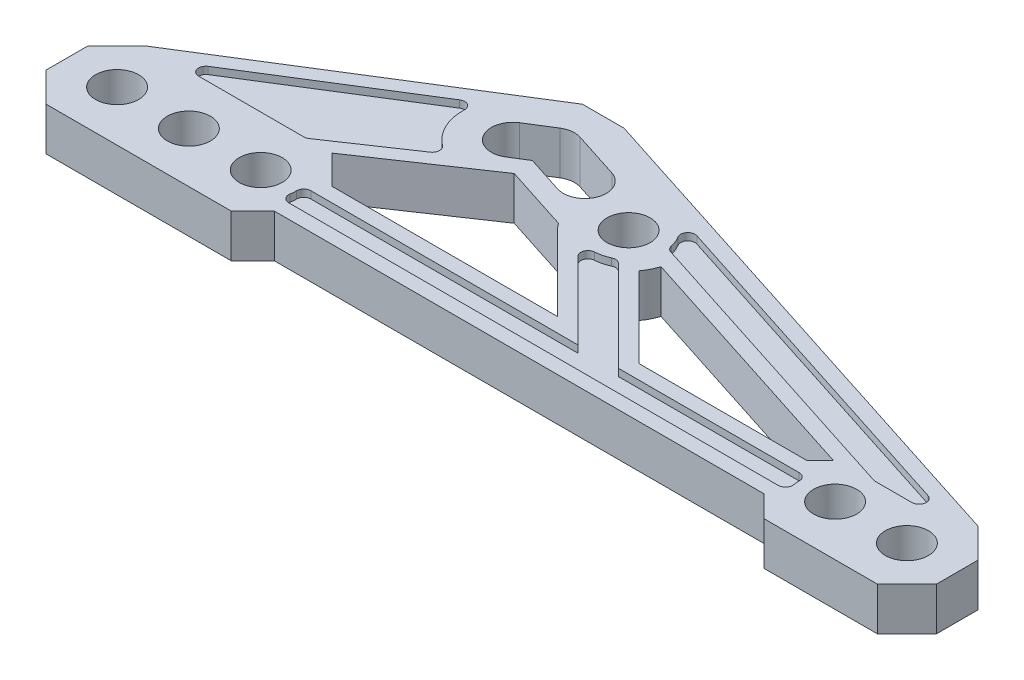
from build123d import *

# Parameters (mm, degrees)
ESQUISSE2_R             = 1.5
BOSS_EXTRU_1_DEPTH      = 1.5
ENL_V_START             = -1
ENL_V_MAT_EXTRU_1_DEPTH = 60.454413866


with BuildPart() as part:
    # Esquisse2 → Boss.-Extru.1 (new, symmetric)
    with BuildSketch(Plane(origin=(0, 0, 0), x_dir=(1, 0, 0), z_dir=(0, 1, 0))):
        Polygon((20.131308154, 15.173534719), (17.231813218, 15.173534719), (-1.449747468, 3.5), (-3.5, 1.449747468), (-3.5, -1.449747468), (-1.449747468, -3.5), (11.449747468, -3.5), (12.949747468, -2), (47.050252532, -2), (48.550252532, -3.5), (56.449747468, -3.5), (58.5, -1.449747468), (58.5, 1.449747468), (56.449747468, 3.5), align=None)
        with Locations(Location((0, 0, 0), (0, 0, 270))):
            Circle(ESQUISSE2_R, mode=Mode.SUBTRACT)
        with Locations(Location((5, 0, 0), (0, 0, 270))):
            Circle(ESQUISSE2_R, mode=Mode.SUBTRACT)
        with Locations(Location((10, 0, 0), (0, 0, 270))):
            Circle(ESQUISSE2_R, mode=Mode.SUBTRACT)
        with Locations(Location((26.439086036, 9.180097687, 0), (0, 0, 270))):
            Circle(ESQUISSE2_R, mode=Mode.SUBTRACT)
        with Locations(Location((50, 0, 0), (0, 0, 270))):
            Circle(ESQUISSE2_R, mode=Mode.SUBTRACT)
        with Locations(Location((55, 0, 0), (0, 0, 270))):
            Circle(ESQUISSE2_R, mode=Mode.SUBTRACT)
        with BuildLine():
            Line((34.826290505, 1.5), (46.550252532, 1.5))
            Line((46.550252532, 1.5), (47.470422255, 2.420169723))
            Line((47.470422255, 2.420169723), (29.771192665, 8.10908629))
            ThreePointArc((29.771192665, 8.10908629), (29.549171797, 7.574679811), (29.24212917, 7.084161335))
            Line((29.24212917, 7.084161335), (34.826290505, 1.5))
        make_face(mode=Mode.SUBTRACT)
        with BuildLine():
            Line((16.166083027, 11.870457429), (17.88668179, 12.945606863))
            ThreePointArc((17.88668179, 12.945606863), (18.496399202, 13.16206259), (19.14056557, 13.101580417))
            Line((19.14056557, 13.101580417), (22.403449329, 12.052818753))
            ThreePointArc((22.403449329, 12.052818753), (23.372490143, 10.165768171), (21.48543956, 9.196727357))
            Line((21.48543956, 9.196727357), (18.88571328, 10.032335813))
            Line((18.88571328, 10.032335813), (17.755840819, 9.32631314))
            ThreePointArc((17.755840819, 9.32631314), (15.688889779, 9.803506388), (16.166083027, 11.870457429))
        make_face(mode=Mode.SUBTRACT)
        with BuildLine():
            Line((11.449747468, 3.5), (19.03849691, 8.617725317))
            Line((19.03849691, 8.617725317), (23.583012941, 7.157019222))
            ThreePointArc((23.583012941, 7.157019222), (23.764057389, 6.923059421), (23.964212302, 6.705223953))
            Line((23.964212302, 6.705223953), (29.169436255, 1.5))
            Line((29.169436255, 1.5), (13.449747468, 1.5))
            Line((13.449747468, 1.5), (11.449747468, 3.5))
        make_face(mode=Mode.SUBTRACT)
    extrude(amount=BOSS_EXTRU_1_DEPTH, both=True)

    # Esquisse3 → Enl_v. mat.-Extru.1 (cut, through all)
    with BuildSketch(Plane(origin=(0, 0, 0), x_dir=(1, 0, 0), z_dir=(0, 1, 0)).offset(ENL_V_START)):
        with BuildLine():
            Line((2.181039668, 3.5), (9.508385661, 3.5))
            ThreePointArc((9.508385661, 3.5), (9.654550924, 3.521841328), (9.787946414, 3.585457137))
            Line((9.787946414, 3.585457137), (14.834219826, 6.988579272))
            ThreePointArc((14.834219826, 6.988579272), (15.05448913, 7.390087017), (14.85544693, 7.802530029))
            ThreePointArc((14.85544693, 7.802530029), (13.802219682, 9.090954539), (13.463081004, 10.720159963))
            ThreePointArc((13.463081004, 10.720159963), (13.213360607, 11.170582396), (12.698424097, 11.161580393))
            Line((12.698424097, 11.161580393), (1.916080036, 4.424024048))
            ThreePointArc((1.916080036, 4.424024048), (1.70040882, 3.862181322), (2.181039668, 3.5))
        make_face()
        with BuildLine():
            Line((50.188976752, 2.62194713), (52.724028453, 2.62194713))
            ThreePointArc((52.724028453, 2.62194713), (53.217995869, 3.044512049), (52.877030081, 3.597962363))
            Line((52.877030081, 3.597962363), (29.149448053, 11.224522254))
            ThreePointArc((29.149448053, 11.224522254), (28.603243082, 11.057361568), (28.570219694, 10.487105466))
            ThreePointArc((28.570219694, 10.487105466), (28.75947381, 10.110581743), (28.882796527, 9.707619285))
            ThreePointArc((28.882796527, 9.707619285), (29.001027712, 9.477383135), (29.218536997, 9.337108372))
            Line((29.218536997, 9.337108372), (50.035975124, 2.645931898))
            ThreePointArc((50.035975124, 2.645931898), (50.111541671, 2.627979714), (50.188976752, 2.62194713))
        make_face()
        with BuildLine():
            Line((12.958039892, -1), (47.041960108, -1))
            ThreePointArc((47.041960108, -1), (47.423841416, -0.822748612), (47.534966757, -0.416666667))
            ThreePointArc((47.534966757, -0.416666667), (47.508757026, -0.209065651), (47.5, 0))
            ThreePointArc((47.5, 0), (47.353553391, 0.353553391), (47, 0.5))
            Line((47, 0.5), (34.412076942, 0.5))
            Line((34.412076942, 0.5), (28.085532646, 6.826544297))
            ThreePointArc((28.085532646, 6.826544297), (27.816530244, 6.965790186), (27.516497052, 6.92417537))
            ThreePointArc((27.516497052, 6.92417537), (27.059087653, 6.758198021), (26.578190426, 6.683970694))
            ThreePointArc((26.578190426, 6.683970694), (26.138925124, 6.36315634), (26.252457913, 5.831191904))
            Line((26.252457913, 5.831191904), (31.583649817, 0.5))
            Line((31.583649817, 0.5), (13, 0.5))
            ThreePointArc((13, 0.5), (12.646446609, 0.353553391), (12.5, 0))
            ThreePointArc((12.5, 0), (12.491242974, -0.209065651), (12.465033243, -0.416666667))
            ThreePointArc((12.465033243, -0.416666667), (12.576158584, -0.822748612), (12.958039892, -1))
        make_face()
    enl_v_mat_extru_1 = extrude(amount=-ENL_V_MAT_EXTRU_1_DEPTH, mode=Mode.SUBTRACT)

    # Sym_trie1: Enl_v. mat.-Extru.1 across plane
    add(enl_v_mat_extru_1.mirror(Plane.ZX), mode=Mode.SUBTRACT)


solid = part.part
